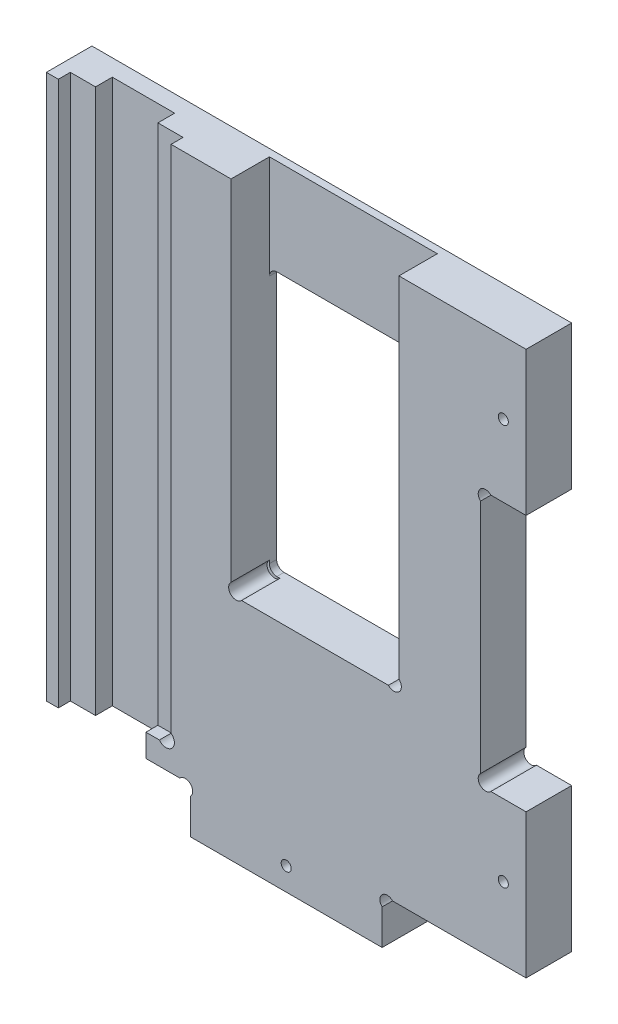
ISO-10303-21;
HEADER;
FILE_DESCRIPTION(('STEP AP214'),'2;1');
FILE_NAME('part.step','',(''),(''),'','','');
FILE_SCHEMA(('AUTOMOTIVE_DESIGN { 1 0 10303 214 1 1 1 1 }'));
ENDSEC;
DATA;
#1=APPLICATION_CONTEXT('core data for automotive mechanical design processes');
#2=APPLICATION_PROTOCOL_DEFINITION('international standard','automotive_design',2000,#1);
#3=PRODUCT_CONTEXT('',#1,'mechanical');
#4=PRODUCT('Part','Part','',(#3));
#5=PRODUCT_RELATED_PRODUCT_CATEGORY('part','',(#4));
#6=PRODUCT_DEFINITION_FORMATION('','',#4);
#7=PRODUCT_DEFINITION_CONTEXT('part definition',#1,'design');
#8=PRODUCT_DEFINITION('design','',#6,#7);
#9=PRODUCT_DEFINITION_SHAPE('','',#8);
#10=(LENGTH_UNIT() NAMED_UNIT(*) SI_UNIT(.MILLI.,.METRE.));
#11=(NAMED_UNIT(*) PLANE_ANGLE_UNIT() SI_UNIT($,.RADIAN.));
#12=(NAMED_UNIT(*) SI_UNIT($,.STERADIAN.) SOLID_ANGLE_UNIT());
#13=UNCERTAINTY_MEASURE_WITH_UNIT(LENGTH_MEASURE(1.E-05),#10,'distance_accuracy_value','');
#14=(GEOMETRIC_REPRESENTATION_CONTEXT(3) GLOBAL_UNCERTAINTY_ASSIGNED_CONTEXT((#13)) GLOBAL_UNIT_ASSIGNED_CONTEXT((#10,
#11,#12)) REPRESENTATION_CONTEXT('',''));
#15=CARTESIAN_POINT('',(0.,0.,0.));
#16=DIRECTION('',(0.,0.,1.));
#17=DIRECTION('',(1.,0.,0.));
#18=AXIS2_PLACEMENT_3D('',#15,#16,#17);
#19=CARTESIAN_POINT('',(655.629179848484,98.1,3.));
#20=DIRECTION('',(0.,0.,1.));
#21=DIRECTION('',(1.,0.,0.));
#22=AXIS2_PLACEMENT_3D('',#19,#20,#21);
#23=PLANE('',#22);
#24=CARTESIAN_POINT('',(590.829179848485,202.9,3.));
#25=DIRECTION('',(0.,0.,1.));
#26=DIRECTION('',(1.,0.,0.));
#27=AXIS2_PLACEMENT_3D('',#24,#25,#26);
#28=CIRCLE('',#27,3.09999999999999);
#29=CARTESIAN_POINT('',(590.829179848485,206.,3.));
#30=VERTEX_POINT('',#29);
#31=CARTESIAN_POINT('',(587.729179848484,202.9,3.));
#32=VERTEX_POINT('',#31);
#33=EDGE_CURVE('E319',#30,#32,#28,.T.);
#34=ORIENTED_EDGE('',*,*,#33,.F.);
#35=DIRECTION('',(-1.,0.,0.));
#36=VECTOR('',#35,1.);
#37=CARTESIAN_POINT('',(590.829179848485,206.,3.));
#38=LINE('',#37,#36);
#39=CARTESIAN_POINT('',(654.629179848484,206.,3.));
#40=VERTEX_POINT('',#39);
#41=EDGE_CURVE('E347',#40,#30,#38,.T.);
#42=ORIENTED_EDGE('',*,*,#41,.F.);
#43=CARTESIAN_POINT('',(654.629179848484,202.9,3.));
#44=DIRECTION('',(0.,0.,1.));
#45=DIRECTION('',(-1.,0.,0.));
#46=AXIS2_PLACEMENT_3D('',#43,#44,#45);
#47=CIRCLE('',#46,3.09999999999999);
#48=CARTESIAN_POINT('',(657.729179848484,202.9,3.));
#49=VERTEX_POINT('',#48);
#50=EDGE_CURVE('E344',#49,#40,#47,.T.);
#51=ORIENTED_EDGE('',*,*,#50,.F.);
#52=DIRECTION('',(0.,1.,0.));
#53=VECTOR('',#52,1.);
#54=CARTESIAN_POINT('',(657.729179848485,100.380350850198,3.));
#55=LINE('',#54,#53);
#56=CARTESIAN_POINT('',(657.729179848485,246.,3.));
#57=VERTEX_POINT('',#56);
#58=EDGE_CURVE('E57',#49,#57,#55,.T.);
#59=ORIENTED_EDGE('',*,*,#58,.T.);
#60=DIRECTION('',(-1.,0.,0.));
#61=VECTOR('',#60,1.);
#62=CARTESIAN_POINT('',(710.729179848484,246.,3.));
#63=LINE('',#62,#61);
#64=CARTESIAN_POINT('',(587.729179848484,246.,3.));
#65=VERTEX_POINT('',#64);
#66=EDGE_CURVE('E605',#57,#65,#63,.T.);
#67=ORIENTED_EDGE('',*,*,#66,.T.);
#68=DIRECTION('',(0.,-1.,0.));
#69=VECTOR('',#68,1.);
#70=CARTESIAN_POINT('',(587.729179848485,100.380350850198,3.));
#71=LINE('',#70,#69);
#72=EDGE_CURVE('E366',#65,#32,#71,.T.);
#73=ORIENTED_EDGE('',*,*,#72,.T.);
#74=EDGE_LOOP('',(#34,#42,#51,#59,#67,#73));
#75=FACE_BOUND('',#74,.T.);
#76=ADVANCED_FACE('F34',(#75),#23,.T.);
#77=DIRECTION('',(0.,-1.,0.));
#78=VECTOR('',#77,1.);
#79=CARTESIAN_POINT('',(587.729179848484,202.9,3.));
#80=LINE('',#79,#78);
#81=CARTESIAN_POINT('',(587.729179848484,100.380350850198,3.));
#82=VERTEX_POINT('',#81);
#83=CARTESIAN_POINT('',(587.729179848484,99.1,3.));
#84=VERTEX_POINT('',#83);
#85=EDGE_CURVE('E317',#82,#84,#80,.T.);
#86=ORIENTED_EDGE('',*,*,#85,.F.);
#87=CARTESIAN_POINT('',(589.829179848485,98.1,3.));
#88=DIRECTION('',(0.,0.,1.));
#89=DIRECTION('',(1.,0.,0.));
#90=AXIS2_PLACEMENT_3D('',#87,#88,#89);
#91=CIRCLE('',#90,3.09999999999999);
#92=CARTESIAN_POINT('',(592.109530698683,96.,3.));
#93=VERTEX_POINT('',#92);
#94=EDGE_CURVE('E369',#82,#93,#91,.T.);
#95=ORIENTED_EDGE('',*,*,#94,.T.);
#96=DIRECTION('',(1.,0.,0.));
#97=VECTOR('',#96,1.);
#98=CARTESIAN_POINT('',(590.829179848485,96.,3.));
#99=LINE('',#98,#97);
#100=CARTESIAN_POINT('',(590.829179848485,96.,3.));
#101=VERTEX_POINT('',#100);
#102=EDGE_CURVE('E337',#101,#93,#99,.T.);
#103=ORIENTED_EDGE('',*,*,#102,.F.);
#104=CARTESIAN_POINT('',(590.829179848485,99.1,3.));
#105=DIRECTION('',(0.,0.,1.));
#106=DIRECTION('',(1.,0.,0.));
#107=AXIS2_PLACEMENT_3D('',#104,#105,#106);
#108=CIRCLE('',#107,3.1);
#109=EDGE_CURVE('E301',#84,#101,#108,.T.);
#110=ORIENTED_EDGE('',*,*,#109,.F.);
#111=EDGE_LOOP('',(#86,#95,#103,#110));
#112=FACE_BOUND('',#111,.T.);
#113=ADVANCED_FACE('F628',(#112),#23,.T.);
#114=CARTESIAN_POINT('',(526.229179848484,250.709420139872,7.));
#115=DIRECTION('',(-1.,0.,0.));
#116=DIRECTION('',(0.,0.,1.));
#117=AXIS2_PLACEMENT_3D('',#114,#115,#116);
#118=PLANE('',#117);
#119=DIRECTION('',(0.,1.,0.));
#120=VECTOR('',#119,1.);
#121=CARTESIAN_POINT('',(526.229179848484,250.709420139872,14.));
#122=LINE('',#121,#120);
#123=CARTESIAN_POINT('',(526.229179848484,19.,14.));
#124=VERTEX_POINT('',#123);
#125=CARTESIAN_POINT('',(526.229179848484,246.,14.));
#126=VERTEX_POINT('',#125);
#127=EDGE_CURVE('E600',#124,#126,#122,.T.);
#128=ORIENTED_EDGE('',*,*,#127,.F.);
#129=DIRECTION('',(0.,0.,1.));
#130=VECTOR('',#129,1.);
#131=CARTESIAN_POINT('',(526.229179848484,19.,19.));
#132=LINE('',#131,#130);
#133=CARTESIAN_POINT('',(526.229179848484,19.,7.));
#134=VERTEX_POINT('',#133);
#135=EDGE_CURVE('E589',#134,#124,#132,.T.);
#136=ORIENTED_EDGE('',*,*,#135,.F.);
#137=DIRECTION('',(0.,-1.,0.));
#138=VECTOR('',#137,1.);
#139=CARTESIAN_POINT('',(526.229179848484,250.709420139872,7.));
#140=LINE('',#139,#138);
#141=CARTESIAN_POINT('',(526.229179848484,246.,7.));
#142=VERTEX_POINT('',#141);
#143=EDGE_CURVE('E432',#142,#134,#140,.T.);
#144=ORIENTED_EDGE('',*,*,#143,.F.);
#145=DIRECTION('',(0.,0.,-1.));
#146=VECTOR('',#145,1.);
#147=CARTESIAN_POINT('',(526.229179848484,246.,19.));
#148=LINE('',#147,#146);
#149=EDGE_CURVE('E445',#126,#142,#148,.T.);
#150=ORIENTED_EDGE('',*,*,#149,.F.);
#151=EDGE_LOOP('',(#128,#136,#144,#150));
#152=FACE_BOUND('',#151,.T.);
#153=ADVANCED_FACE('F659',(#152),#118,.F.);
#154=CARTESIAN_POINT('',(693.829179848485,183.9,19.));
#155=DIRECTION('',(0.,0.,-1.));
#156=DIRECTION('',(-1.,0.,0.));
#157=AXIS2_PLACEMENT_3D('',#154,#155,#156);
#158=PLANE('',#157);
#159=DIRECTION('',(1.,0.,0.));
#160=VECTOR('',#159,1.);
#161=CARTESIAN_POINT('',(566.348828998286,19.,19.));
#162=LINE('',#161,#160);
#163=CARTESIAN_POINT('',(510.729179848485,19.,19.));
#164=VERTEX_POINT('',#163);
#165=CARTESIAN_POINT('',(515.729179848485,19.,19.));
#166=VERTEX_POINT('',#165);
#167=EDGE_CURVE('E482',#164,#166,#162,.T.);
#168=ORIENTED_EDGE('',*,*,#167,.T.);
#169=DIRECTION('',(0.,-1.,0.));
#170=VECTOR('',#169,1.);
#171=CARTESIAN_POINT('',(515.729179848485,251.308022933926,19.));
#172=LINE('',#171,#170);
#173=CARTESIAN_POINT('',(515.729179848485,246.,19.));
#174=VERTEX_POINT('',#173);
#175=EDGE_CURVE('E390',#174,#166,#172,.T.);
#176=ORIENTED_EDGE('',*,*,#175,.F.);
#177=DIRECTION('',(-1.,0.,0.));
#178=VECTOR('',#177,1.);
#179=CARTESIAN_POINT('',(710.729179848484,246.,19.));
#180=LINE('',#179,#178);
#181=CARTESIAN_POINT('',(510.729179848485,246.,19.));
#182=VERTEX_POINT('',#181);
#183=EDGE_CURVE('E474',#174,#182,#180,.T.);
#184=ORIENTED_EDGE('',*,*,#183,.T.);
#185=DIRECTION('',(0.,-1.,0.));
#186=VECTOR('',#185,1.);
#187=CARTESIAN_POINT('',(510.729179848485,19.,19.));
#188=LINE('',#187,#186);
#189=EDGE_CURVE('E478',#182,#164,#188,.T.);
#190=ORIENTED_EDGE('',*,*,#189,.T.);
#191=EDGE_LOOP('',(#168,#176,#184,#190));
#192=FACE_BOUND('',#191,.T.);
#193=ADVANCED_FACE('F710',(#192),#158,.F.);
#194=CARTESIAN_POINT('',(701.229179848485,49.,19.));
#195=DIRECTION('',(0.,0.,1.));
#196=DIRECTION('',(-1.,0.,0.));
#197=AXIS2_PLACEMENT_3D('',#194,#195,#196);
#198=CIRCLE('',#197,2.10000000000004);
#199=CARTESIAN_POINT('',(699.129179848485,49.,19.));
#200=VERTEX_POINT('',#199);
#201=EDGE_CURVE('E454',#200,#200,#198,.T.);
#202=ORIENTED_EDGE('',*,*,#201,.F.);
#203=EDGE_LOOP('',(#202));
#204=FACE_BOUND('',#203,.T.);
#205=CARTESIAN_POINT('',(710.729179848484,246.,19.));
#206=VERTEX_POINT('',#205);
#207=CARTESIAN_POINT('',(657.729179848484,246.,19.));
#208=VERTEX_POINT('',#207);
#209=EDGE_CURVE('E475',#206,#208,#180,.T.);
#210=ORIENTED_EDGE('',*,*,#209,.T.);
#211=DIRECTION('',(0.,1.,0.));
#212=VECTOR('',#211,1.);
#213=CARTESIAN_POINT('',(657.729179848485,100.380350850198,19.));
#214=LINE('',#213,#212);
#215=CARTESIAN_POINT('',(657.729179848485,100.380350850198,19.));
#216=VERTEX_POINT('',#215);
#217=EDGE_CURVE('E370',#216,#208,#214,.T.);
#218=ORIENTED_EDGE('',*,*,#217,.F.);
#219=CARTESIAN_POINT('',(655.629179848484,98.1,19.));
#220=DIRECTION('',(0.,0.,1.));
#221=DIRECTION('',(1.,0.,0.));
#222=AXIS2_PLACEMENT_3D('',#219,#220,#221);
#223=CIRCLE('',#222,3.1);
#224=CARTESIAN_POINT('',(653.348828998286,96.,19.));
#225=VERTEX_POINT('',#224);
#226=EDGE_CURVE('E384',#225,#216,#223,.T.);
#227=ORIENTED_EDGE('',*,*,#226,.F.);
#228=DIRECTION('',(1.,0.,0.));
#229=VECTOR('',#228,1.);
#230=CARTESIAN_POINT('',(592.109530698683,96.,19.));
#231=LINE('',#230,#229);
#232=CARTESIAN_POINT('',(592.109530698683,96.,19.));
#233=VERTEX_POINT('',#232);
#234=EDGE_CURVE('E382',#233,#225,#231,.T.);
#235=ORIENTED_EDGE('',*,*,#234,.F.);
#236=CARTESIAN_POINT('',(589.829179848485,98.1,19.));
#237=DIRECTION('',(0.,0.,1.));
#238=DIRECTION('',(1.,0.,0.));
#239=AXIS2_PLACEMENT_3D('',#236,#237,#238);
#240=CIRCLE('',#239,3.09999999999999);
#241=CARTESIAN_POINT('',(587.729179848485,100.380350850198,19.));
#242=VERTEX_POINT('',#241);
#243=EDGE_CURVE('E379',#242,#233,#240,.T.);
#244=ORIENTED_EDGE('',*,*,#243,.F.);
#245=DIRECTION('',(0.,-1.,0.));
#246=VECTOR('',#245,1.);
#247=CARTESIAN_POINT('',(587.729179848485,100.380350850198,19.));
#248=LINE('',#247,#246);
#249=CARTESIAN_POINT('',(587.729179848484,246.,19.));
#250=VERTEX_POINT('',#249);
#251=EDGE_CURVE('E354',#250,#242,#248,.T.);
#252=ORIENTED_EDGE('',*,*,#251,.F.);
#253=CARTESIAN_POINT('',(562.729179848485,246.,19.));
#254=VERTEX_POINT('',#253);
#255=EDGE_CURVE('E479',#250,#254,#180,.T.);
#256=ORIENTED_EDGE('',*,*,#255,.T.);
#257=DIRECTION('',(0.,1.,0.));
#258=VECTOR('',#257,1.);
#259=CARTESIAN_POINT('',(562.729179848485,251.308022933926,19.));
#260=LINE('',#259,#258);
#261=CARTESIAN_POINT('',(562.729179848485,33.3803508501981,19.));
#262=VERTEX_POINT('',#261);
#263=EDGE_CURVE('E408',#262,#254,#260,.T.);
#264=ORIENTED_EDGE('',*,*,#263,.F.);
#265=CARTESIAN_POINT('',(560.629179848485,30.6,19.));
#266=DIRECTION('',(0.,0.,1.));
#267=DIRECTION('',(1.,0.,0.));
#268=AXIS2_PLACEMENT_3D('',#265,#266,#267);
#269=CIRCLE('',#268,3.48430062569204);
#270=CARTESIAN_POINT('',(557.848828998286,28.5,19.));
#271=VERTEX_POINT('',#270);
#272=EDGE_CURVE('E413',#271,#262,#269,.T.);
#273=ORIENTED_EDGE('',*,*,#272,.F.);
#274=DIRECTION('',(1.,0.,0.));
#275=VECTOR('',#274,1.);
#276=CARTESIAN_POINT('',(557.848828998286,28.5,19.));
#277=LINE('',#276,#275);
#278=CARTESIAN_POINT('',(552.229179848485,28.5,19.));
#279=VERTEX_POINT('',#278);
#280=EDGE_CURVE('E421',#279,#271,#277,.T.);
#281=ORIENTED_EDGE('',*,*,#280,.F.);
#282=DIRECTION('',(0.,1.,0.));
#283=VECTOR('',#282,1.);
#284=CARTESIAN_POINT('',(552.229179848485,250.709420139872,19.));
#285=LINE('',#284,#283);
#286=CARTESIAN_POINT('',(552.229179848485,19.,19.));
#287=VERTEX_POINT('',#286);
#288=EDGE_CURVE('E431',#287,#279,#285,.T.);
#289=ORIENTED_EDGE('',*,*,#288,.F.);
#290=CARTESIAN_POINT('',(566.348828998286,19.,19.));
#291=VERTEX_POINT('',#290);
#292=EDGE_CURVE('E481',#287,#291,#162,.T.);
#293=ORIENTED_EDGE('',*,*,#292,.T.);
#294=CARTESIAN_POINT('',(568.629179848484,16.9,19.));
#295=DIRECTION('',(0.,0.,-1.));
#296=DIRECTION('',(-1.,0.,0.));
#297=AXIS2_PLACEMENT_3D('',#294,#295,#296);
#298=CIRCLE('',#297,3.09999999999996);
#299=CARTESIAN_POINT('',(570.729179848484,14.6196491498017,19.));
#300=VERTEX_POINT('',#299);
#301=EDGE_CURVE('E485',#291,#300,#298,.T.);
#302=ORIENTED_EDGE('',*,*,#301,.T.);
#303=DIRECTION('',(0.,-1.,0.));
#304=VECTOR('',#303,1.);
#305=CARTESIAN_POINT('',(570.729179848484,0.,19.));
#306=LINE('',#305,#304);
#307=CARTESIAN_POINT('',(570.729179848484,0.,19.));
#308=VERTEX_POINT('',#307);
#309=EDGE_CURVE('E487',#300,#308,#306,.T.);
#310=ORIENTED_EDGE('',*,*,#309,.T.);
#311=DIRECTION('',(1.,0.,0.));
#312=VECTOR('',#311,1.);
#313=CARTESIAN_POINT('',(650.729179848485,0.,19.));
#314=LINE('',#313,#312);
#315=CARTESIAN_POINT('',(650.729179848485,0.,19.));
#316=VERTEX_POINT('',#315);
#317=EDGE_CURVE('E489',#308,#316,#314,.T.);
#318=ORIENTED_EDGE('',*,*,#317,.T.);
#319=DIRECTION('',(0.,1.,0.));
#320=VECTOR('',#319,1.);
#321=CARTESIAN_POINT('',(650.729179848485,0.,19.));
#322=LINE('',#321,#320);
#323=CARTESIAN_POINT('',(650.729179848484,14.6881003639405,19.));
#324=VERTEX_POINT('',#323);
#325=EDGE_CURVE('E491',#316,#324,#322,.T.);
#326=ORIENTED_EDGE('',*,*,#325,.T.);
#327=CARTESIAN_POINT('',(652.829179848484,16.9,19.));
#328=DIRECTION('',(0.,0.,-1.));
#329=DIRECTION('',(-1.,0.,0.));
#330=AXIS2_PLACEMENT_3D('',#327,#328,#329);
#331=CIRCLE('',#330,3.05000000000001);
#332=CARTESIAN_POINT('',(655.041079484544,19.,19.));
#333=VERTEX_POINT('',#332);
#334=EDGE_CURVE('E493',#324,#333,#331,.T.);
#335=ORIENTED_EDGE('',*,*,#334,.T.);
#336=DIRECTION('',(1.,0.,0.));
#337=VECTOR('',#336,1.);
#338=CARTESIAN_POINT('',(655.041079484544,19.,19.));
#339=LINE('',#338,#337);
#340=CARTESIAN_POINT('',(710.729179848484,19.,19.));
#341=VERTEX_POINT('',#340);
#342=EDGE_CURVE('E495',#333,#341,#339,.T.);
#343=ORIENTED_EDGE('',*,*,#342,.T.);
#344=DIRECTION('',(0.,1.,0.));
#345=VECTOR('',#344,1.);
#346=CARTESIAN_POINT('',(710.729179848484,19.,19.));
#347=LINE('',#346,#345);
#348=CARTESIAN_POINT('',(710.729179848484,79.0000000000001,19.));
#349=VERTEX_POINT('',#348);
#350=EDGE_CURVE('E497',#341,#349,#347,.T.);
#351=ORIENTED_EDGE('',*,*,#350,.T.);
#352=DIRECTION('',(-1.,0.,0.));
#353=VECTOR('',#352,1.);
#354=CARTESIAN_POINT('',(696.041079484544,79.0000000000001,19.));
#355=LINE('',#354,#353);
#356=CARTESIAN_POINT('',(696.041079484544,79.0000000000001,19.));
#357=VERTEX_POINT('',#356);
#358=EDGE_CURVE('E499',#349,#357,#355,.T.);
#359=ORIENTED_EDGE('',*,*,#358,.T.);
#360=CARTESIAN_POINT('',(693.829179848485,81.1000000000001,19.));
#361=DIRECTION('',(0.,0.,-1.));
#362=DIRECTION('',(-1.,0.,0.));
#363=AXIS2_PLACEMENT_3D('',#360,#361,#362);
#364=CIRCLE('',#363,3.05000000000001);
#365=CARTESIAN_POINT('',(691.729179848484,83.3118996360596,19.));
#366=VERTEX_POINT('',#365);
#367=EDGE_CURVE('E501',#357,#366,#364,.T.);
#368=ORIENTED_EDGE('',*,*,#367,.T.);
#369=DIRECTION('',(0.,1.,0.));
#370=VECTOR('',#369,1.);
#371=CARTESIAN_POINT('',(691.729179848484,181.688100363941,19.));
#372=LINE('',#371,#370);
#373=CARTESIAN_POINT('',(691.729179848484,181.688100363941,19.));
#374=VERTEX_POINT('',#373);
#375=EDGE_CURVE('E503',#366,#374,#372,.T.);
#376=ORIENTED_EDGE('',*,*,#375,.T.);
#377=CARTESIAN_POINT('',(693.829179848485,183.9,19.));
#378=DIRECTION('',(0.,0.,-1.));
#379=DIRECTION('',(-1.,0.,0.));
#380=AXIS2_PLACEMENT_3D('',#377,#378,#379);
#381=CIRCLE('',#380,3.05000000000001);
#382=CARTESIAN_POINT('',(696.041079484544,186.,19.));
#383=VERTEX_POINT('',#382);
#384=EDGE_CURVE('E466',#374,#383,#381,.T.);
#385=ORIENTED_EDGE('',*,*,#384,.T.);
#386=DIRECTION('',(1.,0.,0.));
#387=VECTOR('',#386,1.);
#388=CARTESIAN_POINT('',(710.729179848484,186.,19.));
#389=LINE('',#388,#387);
#390=CARTESIAN_POINT('',(710.729179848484,186.,19.));
#391=VERTEX_POINT('',#390);
#392=EDGE_CURVE('E469',#383,#391,#389,.T.);
#393=ORIENTED_EDGE('',*,*,#392,.T.);
#394=DIRECTION('',(0.,1.,0.));
#395=VECTOR('',#394,1.);
#396=CARTESIAN_POINT('',(710.729179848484,186.,19.));
#397=LINE('',#396,#395);
#398=EDGE_CURVE('E472',#391,#206,#397,.T.);
#399=ORIENTED_EDGE('',*,*,#398,.T.);
#400=EDGE_LOOP('',(#210,#218,#227,#235,#244,#252,#256,#264,#273,#281,#289,#293,#302,#310,#318,
#326,#335,#343,#351,#359,#368,#376,#385,#393,#399));
#401=FACE_BOUND('',#400,.T.);
#402=CARTESIAN_POINT('',(701.229179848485,216.,19.));
#403=DIRECTION('',(0.,0.,1.));
#404=DIRECTION('',(1.,0.,0.));
#405=AXIS2_PLACEMENT_3D('',#402,#403,#404);
#406=CIRCLE('',#405,2.10000000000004);
#407=CARTESIAN_POINT('',(703.329179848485,216.,19.));
#408=VERTEX_POINT('',#407);
#409=EDGE_CURVE('E460',#408,#408,#406,.T.);
#410=ORIENTED_EDGE('',*,*,#409,.F.);
#411=EDGE_LOOP('',(#410));
#412=FACE_BOUND('',#411,.T.);
#413=CARTESIAN_POINT('',(610.729179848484,9.5,19.));
#414=DIRECTION('',(0.,0.,1.));
#415=DIRECTION('',(-1.,0.,0.));
#416=AXIS2_PLACEMENT_3D('',#413,#414,#415);
#417=CIRCLE('',#416,2.10000000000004);
#418=CARTESIAN_POINT('',(608.629179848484,9.5,19.));
#419=VERTEX_POINT('',#418);
#420=EDGE_CURVE('E448',#419,#419,#417,.T.);
#421=ORIENTED_EDGE('',*,*,#420,.F.);
#422=EDGE_LOOP('',(#421));
#423=FACE_BOUND('',#422,.T.);
#424=ADVANCED_FACE('F618',(#204,#401,#412,#423),#158,.F.);
#425=CARTESIAN_POINT('',(693.829179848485,183.9,0.));
#426=DIRECTION('',(0.,0.,-1.));
#427=DIRECTION('',(-1.,0.,0.));
#428=AXIS2_PLACEMENT_3D('',#425,#426,#427);
#429=PLANE('',#428);
#430=CARTESIAN_POINT('',(590.829179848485,99.1,0.));
#431=DIRECTION('',(0.,0.,1.));
#432=DIRECTION('',(1.,0.,0.));
#433=AXIS2_PLACEMENT_3D('',#430,#431,#432);
#434=CIRCLE('',#433,3.1);
#435=CARTESIAN_POINT('',(587.729179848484,99.1,0.));
#436=VERTEX_POINT('',#435);
#437=CARTESIAN_POINT('',(590.829179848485,96.,0.));
#438=VERTEX_POINT('',#437);
#439=EDGE_CURVE('E298',#436,#438,#434,.T.);
#440=ORIENTED_EDGE('',*,*,#439,.T.);
#441=DIRECTION('',(1.,0.,0.));
#442=VECTOR('',#441,1.);
#443=CARTESIAN_POINT('',(590.829179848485,96.,0.));
#444=LINE('',#443,#442);
#445=CARTESIAN_POINT('',(654.629179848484,96.,0.));
#446=VERTEX_POINT('',#445);
#447=EDGE_CURVE('E308',#438,#446,#444,.T.);
#448=ORIENTED_EDGE('',*,*,#447,.T.);
#449=CARTESIAN_POINT('',(654.629179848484,99.1,0.));
#450=DIRECTION('',(0.,0.,1.));
#451=DIRECTION('',(1.,0.,0.));
#452=AXIS2_PLACEMENT_3D('',#449,#450,#451);
#453=CIRCLE('',#452,3.1);
#454=CARTESIAN_POINT('',(657.729179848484,99.1,0.));
#455=VERTEX_POINT('',#454);
#456=EDGE_CURVE('E49',#446,#455,#453,.T.);
#457=ORIENTED_EDGE('',*,*,#456,.T.);
#458=DIRECTION('',(0.,1.,0.));
#459=VECTOR('',#458,1.);
#460=CARTESIAN_POINT('',(657.729179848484,202.9,0.));
#461=LINE('',#460,#459);
#462=CARTESIAN_POINT('',(657.729179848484,202.9,0.));
#463=VERTEX_POINT('',#462);
#464=EDGE_CURVE('E323',#455,#463,#461,.T.);
#465=ORIENTED_EDGE('',*,*,#464,.T.);
#466=CARTESIAN_POINT('',(654.629179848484,202.9,0.));
#467=DIRECTION('',(0.,0.,1.));
#468=DIRECTION('',(-1.,0.,0.));
#469=AXIS2_PLACEMENT_3D('',#466,#467,#468);
#470=CIRCLE('',#469,3.09999999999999);
#471=CARTESIAN_POINT('',(654.629179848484,206.,0.));
#472=VERTEX_POINT('',#471);
#473=EDGE_CURVE('E326',#463,#472,#470,.T.);
#474=ORIENTED_EDGE('',*,*,#473,.T.);
#475=DIRECTION('',(-1.,0.,0.));
#476=VECTOR('',#475,1.);
#477=CARTESIAN_POINT('',(590.829179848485,206.,0.));
#478=LINE('',#477,#476);
#479=CARTESIAN_POINT('',(590.829179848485,206.,0.));
#480=VERTEX_POINT('',#479);
#481=EDGE_CURVE('E329',#472,#480,#478,.T.);
#482=ORIENTED_EDGE('',*,*,#481,.T.);
#483=CARTESIAN_POINT('',(590.829179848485,202.9,0.));
#484=DIRECTION('',(0.,0.,1.));
#485=DIRECTION('',(1.,0.,0.));
#486=AXIS2_PLACEMENT_3D('',#483,#484,#485);
#487=CIRCLE('',#486,3.09999999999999);
#488=CARTESIAN_POINT('',(587.729179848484,202.9,0.));
#489=VERTEX_POINT('',#488);
#490=EDGE_CURVE('E332',#480,#489,#487,.T.);
#491=ORIENTED_EDGE('',*,*,#490,.T.);
#492=DIRECTION('',(0.,-1.,0.));
#493=VECTOR('',#492,1.);
#494=CARTESIAN_POINT('',(587.729179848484,202.9,0.));
#495=LINE('',#494,#493);
#496=EDGE_CURVE('E305',#489,#436,#495,.T.);
#497=ORIENTED_EDGE('',*,*,#496,.T.);
#498=EDGE_LOOP('',(#440,#448,#457,#465,#474,#482,#491,#497));
#499=FACE_BOUND('',#498,.T.);
#500=CARTESIAN_POINT('',(701.229179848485,49.,0.));
#501=DIRECTION('',(0.,0.,1.));
#502=DIRECTION('',(-1.,0.,0.));
#503=AXIS2_PLACEMENT_3D('',#500,#501,#502);
#504=CIRCLE('',#503,2.10000000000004);
#505=CARTESIAN_POINT('',(699.129179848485,49.,0.));
#506=VERTEX_POINT('',#505);
#507=EDGE_CURVE('E451',#506,#506,#504,.T.);
#508=ORIENTED_EDGE('',*,*,#507,.T.);
#509=EDGE_LOOP('',(#508));
#510=FACE_BOUND('',#509,.T.);
#511=CARTESIAN_POINT('',(693.829179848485,183.9,0.));
#512=DIRECTION('',(0.,0.,-1.));
#513=DIRECTION('',(-1.,0.,0.));
#514=AXIS2_PLACEMENT_3D('',#511,#512,#513);
#515=CIRCLE('',#514,3.05000000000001);
#516=CARTESIAN_POINT('',(691.729179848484,181.688100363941,0.));
#517=VERTEX_POINT('',#516);
#518=CARTESIAN_POINT('',(696.041079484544,186.,0.));
#519=VERTEX_POINT('',#518);
#520=EDGE_CURVE('E463',#517,#519,#515,.T.);
#521=ORIENTED_EDGE('',*,*,#520,.F.);
#522=DIRECTION('',(0.,1.,0.));
#523=VECTOR('',#522,1.);
#524=CARTESIAN_POINT('',(691.729179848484,181.688100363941,0.));
#525=LINE('',#524,#523);
#526=CARTESIAN_POINT('',(691.729179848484,83.3118996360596,0.));
#527=VERTEX_POINT('',#526);
#528=EDGE_CURVE('E470',#527,#517,#525,.T.);
#529=ORIENTED_EDGE('',*,*,#528,.F.);
#530=CARTESIAN_POINT('',(693.829179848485,81.1000000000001,0.));
#531=DIRECTION('',(0.,0.,-1.));
#532=DIRECTION('',(-1.,0.,0.));
#533=AXIS2_PLACEMENT_3D('',#530,#531,#532);
#534=CIRCLE('',#533,3.05000000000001);
#535=CARTESIAN_POINT('',(696.041079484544,79.0000000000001,0.));
#536=VERTEX_POINT('',#535);
#537=EDGE_CURVE('E534',#536,#527,#534,.T.);
#538=ORIENTED_EDGE('',*,*,#537,.F.);
#539=DIRECTION('',(-1.,0.,0.));
#540=VECTOR('',#539,1.);
#541=CARTESIAN_POINT('',(696.041079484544,79.0000000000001,0.));
#542=LINE('',#541,#540);
#543=CARTESIAN_POINT('',(710.729179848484,79.0000000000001,0.));
#544=VERTEX_POINT('',#543);
#545=EDGE_CURVE('E532',#544,#536,#542,.T.);
#546=ORIENTED_EDGE('',*,*,#545,.F.);
#547=DIRECTION('',(0.,1.,0.));
#548=VECTOR('',#547,1.);
#549=CARTESIAN_POINT('',(710.729179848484,19.,0.));
#550=LINE('',#549,#548);
#551=CARTESIAN_POINT('',(710.729179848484,19.,0.));
#552=VERTEX_POINT('',#551);
#553=EDGE_CURVE('E530',#552,#544,#550,.T.);
#554=ORIENTED_EDGE('',*,*,#553,.F.);
#555=DIRECTION('',(1.,0.,0.));
#556=VECTOR('',#555,1.);
#557=CARTESIAN_POINT('',(655.041079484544,19.,0.));
#558=LINE('',#557,#556);
#559=CARTESIAN_POINT('',(655.041079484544,19.,0.));
#560=VERTEX_POINT('',#559);
#561=EDGE_CURVE('E528',#560,#552,#558,.T.);
#562=ORIENTED_EDGE('',*,*,#561,.F.);
#563=CARTESIAN_POINT('',(652.829179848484,16.9,0.));
#564=DIRECTION('',(0.,0.,-1.));
#565=DIRECTION('',(-1.,0.,0.));
#566=AXIS2_PLACEMENT_3D('',#563,#564,#565);
#567=CIRCLE('',#566,3.05000000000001);
#568=CARTESIAN_POINT('',(650.729179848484,14.6881003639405,0.));
#569=VERTEX_POINT('',#568);
#570=EDGE_CURVE('E526',#569,#560,#567,.T.);
#571=ORIENTED_EDGE('',*,*,#570,.F.);
#572=DIRECTION('',(0.,1.,0.));
#573=VECTOR('',#572,1.);
#574=CARTESIAN_POINT('',(650.729179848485,0.,0.));
#575=LINE('',#574,#573);
#576=CARTESIAN_POINT('',(650.729179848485,0.,0.));
#577=VERTEX_POINT('',#576);
#578=EDGE_CURVE('E524',#577,#569,#575,.T.);
#579=ORIENTED_EDGE('',*,*,#578,.F.);
#580=DIRECTION('',(1.,0.,0.));
#581=VECTOR('',#580,1.);
#582=CARTESIAN_POINT('',(650.729179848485,0.,0.));
#583=LINE('',#582,#581);
#584=CARTESIAN_POINT('',(570.729179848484,0.,0.));
#585=VERTEX_POINT('',#584);
#586=EDGE_CURVE('E522',#585,#577,#583,.T.);
#587=ORIENTED_EDGE('',*,*,#586,.F.);
#588=DIRECTION('',(0.,-1.,0.));
#589=VECTOR('',#588,1.);
#590=CARTESIAN_POINT('',(570.729179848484,0.,0.));
#591=LINE('',#590,#589);
#592=CARTESIAN_POINT('',(570.729179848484,14.6196491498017,0.));
#593=VERTEX_POINT('',#592);
#594=EDGE_CURVE('E520',#593,#585,#591,.T.);
#595=ORIENTED_EDGE('',*,*,#594,.F.);
#596=CARTESIAN_POINT('',(568.629179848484,16.9,0.));
#597=DIRECTION('',(0.,0.,-1.));
#598=DIRECTION('',(-1.,0.,0.));
#599=AXIS2_PLACEMENT_3D('',#596,#597,#598);
#600=CIRCLE('',#599,3.09999999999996);
#601=CARTESIAN_POINT('',(566.348828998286,19.,0.));
#602=VERTEX_POINT('',#601);
#603=EDGE_CURVE('E518',#602,#593,#600,.T.);
#604=ORIENTED_EDGE('',*,*,#603,.F.);
#605=DIRECTION('',(1.,0.,0.));
#606=VECTOR('',#605,1.);
#607=CARTESIAN_POINT('',(566.348828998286,19.,0.));
#608=LINE('',#607,#606);
#609=CARTESIAN_POINT('',(510.729179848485,19.,0.));
#610=VERTEX_POINT('',#609);
#611=EDGE_CURVE('E516',#610,#602,#608,.T.);
#612=ORIENTED_EDGE('',*,*,#611,.F.);
#613=DIRECTION('',(0.,-1.,0.));
#614=VECTOR('',#613,1.);
#615=CARTESIAN_POINT('',(510.729179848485,19.,0.));
#616=LINE('',#615,#614);
#617=CARTESIAN_POINT('',(510.729179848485,246.,0.));
#618=VERTEX_POINT('',#617);
#619=EDGE_CURVE('E514',#618,#610,#616,.T.);
#620=ORIENTED_EDGE('',*,*,#619,.F.);
#621=DIRECTION('',(-1.,0.,0.));
#622=VECTOR('',#621,1.);
#623=CARTESIAN_POINT('',(710.729179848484,246.,0.));
#624=LINE('',#623,#622);
#625=CARTESIAN_POINT('',(710.729179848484,246.,0.));
#626=VERTEX_POINT('',#625);
#627=EDGE_CURVE('E512',#626,#618,#624,.T.);
#628=ORIENTED_EDGE('',*,*,#627,.F.);
#629=DIRECTION('',(0.,1.,0.));
#630=VECTOR('',#629,1.);
#631=CARTESIAN_POINT('',(710.729179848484,186.,0.));
#632=LINE('',#631,#630);
#633=CARTESIAN_POINT('',(710.729179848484,186.,0.));
#634=VERTEX_POINT('',#633);
#635=EDGE_CURVE('E510',#634,#626,#632,.T.);
#636=ORIENTED_EDGE('',*,*,#635,.F.);
#637=DIRECTION('',(1.,0.,0.));
#638=VECTOR('',#637,1.);
#639=CARTESIAN_POINT('',(710.729179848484,186.,0.));
#640=LINE('',#639,#638);
#641=EDGE_CURVE('E508',#519,#634,#640,.T.);
#642=ORIENTED_EDGE('',*,*,#641,.F.);
#643=EDGE_LOOP('',(#521,#529,#538,#546,#554,#562,#571,#579,#587,#595,#604,#612,#620,#628,#636,#642));
#644=FACE_BOUND('',#643,.T.);
#645=CARTESIAN_POINT('',(701.229179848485,216.,0.));
#646=DIRECTION('',(0.,0.,1.));
#647=DIRECTION('',(1.,0.,0.));
#648=AXIS2_PLACEMENT_3D('',#645,#646,#647);
#649=CIRCLE('',#648,2.10000000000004);
#650=CARTESIAN_POINT('',(703.329179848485,216.,0.));
#651=VERTEX_POINT('',#650);
#652=EDGE_CURVE('E457',#651,#651,#649,.T.);
#653=ORIENTED_EDGE('',*,*,#652,.T.);
#654=EDGE_LOOP('',(#653));
#655=FACE_BOUND('',#654,.T.);
#656=CARTESIAN_POINT('',(610.729179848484,9.5,0.));
#657=DIRECTION('',(0.,0.,1.));
#658=DIRECTION('',(-1.,0.,0.));
#659=AXIS2_PLACEMENT_3D('',#656,#657,#658);
#660=CIRCLE('',#659,2.10000000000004);
#661=CARTESIAN_POINT('',(608.629179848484,9.5,0.));
#662=VERTEX_POINT('',#661);
#663=EDGE_CURVE('E447',#662,#662,#660,.T.);
#664=ORIENTED_EDGE('',*,*,#663,.T.);
#665=EDGE_LOOP('',(#664));
#666=FACE_BOUND('',#665,.T.);
#667=ADVANCED_FACE('F313',(#499,#510,#644,#655,#666),#429,.T.);
#668=CARTESIAN_POINT('',(693.829179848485,183.9,19.));
#669=DIRECTION('',(0.,0.,-1.));
#670=DIRECTION('',(-1.,0.,0.));
#671=AXIS2_PLACEMENT_3D('',#668,#669,#670);
#672=CYLINDRICAL_SURFACE('',#671,3.05000000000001);
#673=ORIENTED_EDGE('',*,*,#520,.T.);
#674=DIRECTION('',(0.,0.,-1.));
#675=VECTOR('',#674,1.);
#676=CARTESIAN_POINT('',(696.041079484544,186.,19.));
#677=LINE('',#676,#675);
#678=EDGE_CURVE('E581',#383,#519,#677,.T.);
#679=ORIENTED_EDGE('',*,*,#678,.F.);
#680=ORIENTED_EDGE('',*,*,#384,.F.);
#681=DIRECTION('',(0.,0.,-1.));
#682=VECTOR('',#681,1.);
#683=CARTESIAN_POINT('',(691.729179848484,181.688100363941,19.));
#684=LINE('',#683,#682);
#685=EDGE_CURVE('E505',#374,#517,#684,.T.);
#686=ORIENTED_EDGE('',*,*,#685,.T.);
#687=EDGE_LOOP('',(#673,#679,#680,#686));
#688=FACE_BOUND('',#687,.T.);
#689=ADVANCED_FACE('F36',(#688),#672,.F.);
#690=CARTESIAN_POINT('',(710.729179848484,186.,19.));
#691=DIRECTION('',(0.,1.,0.));
#692=DIRECTION('',(0.,0.,1.));
#693=AXIS2_PLACEMENT_3D('',#690,#691,#692);
#694=PLANE('',#693);
#695=ORIENTED_EDGE('',*,*,#641,.T.);
#696=DIRECTION('',(0.,0.,-1.));
#697=VECTOR('',#696,1.);
#698=CARTESIAN_POINT('',(710.729179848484,186.,19.));
#699=LINE('',#698,#697);
#700=EDGE_CURVE('E578',#391,#634,#699,.T.);
#701=ORIENTED_EDGE('',*,*,#700,.F.);
#702=ORIENTED_EDGE('',*,*,#392,.F.);
#703=ORIENTED_EDGE('',*,*,#678,.T.);
#704=EDGE_LOOP('',(#695,#701,#702,#703));
#705=FACE_BOUND('',#704,.T.);
#706=ADVANCED_FACE('F780',(#705),#694,.F.);
#707=CARTESIAN_POINT('',(710.729179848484,186.,19.));
#708=DIRECTION('',(-1.,0.,0.));
#709=DIRECTION('',(0.,0.,1.));
#710=AXIS2_PLACEMENT_3D('',#707,#708,#709);
#711=PLANE('',#710);
#712=ORIENTED_EDGE('',*,*,#635,.T.);
#713=DIRECTION('',(0.,0.,-1.));
#714=VECTOR('',#713,1.);
#715=CARTESIAN_POINT('',(710.729179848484,246.,19.));
#716=LINE('',#715,#714);
#717=EDGE_CURVE('E575',#206,#626,#716,.T.);
#718=ORIENTED_EDGE('',*,*,#717,.F.);
#719=ORIENTED_EDGE('',*,*,#398,.F.);
#720=ORIENTED_EDGE('',*,*,#700,.T.);
#721=EDGE_LOOP('',(#712,#718,#719,#720));
#722=FACE_BOUND('',#721,.T.);
#723=ADVANCED_FACE('F778',(#722),#711,.F.);
#724=CARTESIAN_POINT('',(710.729179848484,246.,19.));
#725=DIRECTION('',(0.,-1.,0.));
#726=DIRECTION('',(0.,0.,-1.));
#727=AXIS2_PLACEMENT_3D('',#724,#725,#726);
#728=PLANE('',#727);
#729=ORIENTED_EDGE('',*,*,#66,.F.);
#730=DIRECTION('',(0.,0.,1.));
#731=VECTOR('',#730,1.);
#732=CARTESIAN_POINT('',(657.729179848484,246.,19.));
#733=LINE('',#732,#731);
#734=EDGE_CURVE('E11',#57,#208,#733,.T.);
#735=ORIENTED_EDGE('',*,*,#734,.T.);
#736=ORIENTED_EDGE('',*,*,#209,.F.);
#737=ORIENTED_EDGE('',*,*,#717,.T.);
#738=ORIENTED_EDGE('',*,*,#627,.T.);
#739=DIRECTION('',(0.,0.,-1.));
#740=VECTOR('',#739,1.);
#741=CARTESIAN_POINT('',(510.729179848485,246.,19.));
#742=LINE('',#741,#740);
#743=EDGE_CURVE('E572',#182,#618,#742,.T.);
#744=ORIENTED_EDGE('',*,*,#743,.F.);
#745=ORIENTED_EDGE('',*,*,#183,.F.);
#746=DIRECTION('',(0.,0.,-1.));
#747=VECTOR('',#746,1.);
#748=CARTESIAN_POINT('',(515.729179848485,246.,19.));
#749=LINE('',#748,#747);
#750=CARTESIAN_POINT('',(515.729179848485,246.,14.));
#751=VERTEX_POINT('',#750);
#752=EDGE_CURVE('E405',#174,#751,#749,.T.);
#753=ORIENTED_EDGE('',*,*,#752,.T.);
#754=DIRECTION('',(-1.,0.,0.));
#755=VECTOR('',#754,1.);
#756=CARTESIAN_POINT('',(710.729179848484,246.,14.));
#757=LINE('',#756,#755);
#758=EDGE_CURVE('E403',#126,#751,#757,.T.);
#759=ORIENTED_EDGE('',*,*,#758,.F.);
#760=ORIENTED_EDGE('',*,*,#149,.T.);
#761=DIRECTION('',(-1.,0.,0.));
#762=VECTOR('',#761,1.);
#763=CARTESIAN_POINT('',(710.729179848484,246.,7.));
#764=LINE('',#763,#762);
#765=CARTESIAN_POINT('',(552.229179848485,246.,7.));
#766=VERTEX_POINT('',#765);
#767=EDGE_CURVE('E437',#766,#142,#764,.T.);
#768=ORIENTED_EDGE('',*,*,#767,.F.);
#769=DIRECTION('',(0.,0.,1.));
#770=VECTOR('',#769,1.);
#771=CARTESIAN_POINT('',(552.229179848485,246.,19.));
#772=LINE('',#771,#770);
#773=CARTESIAN_POINT('',(552.229179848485,246.,14.));
#774=VERTEX_POINT('',#773);
#775=EDGE_CURVE('E442',#766,#774,#772,.T.);
#776=ORIENTED_EDGE('',*,*,#775,.T.);
#777=DIRECTION('',(-1.,0.,0.));
#778=VECTOR('',#777,1.);
#779=CARTESIAN_POINT('',(710.729179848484,246.,14.));
#780=LINE('',#779,#778);
#781=CARTESIAN_POINT('',(562.729179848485,246.,14.));
#782=VERTEX_POINT('',#781);
#783=EDGE_CURVE('E427',#782,#774,#780,.T.);
#784=ORIENTED_EDGE('',*,*,#783,.F.);
#785=DIRECTION('',(0.,0.,1.));
#786=VECTOR('',#785,1.);
#787=CARTESIAN_POINT('',(562.729179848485,246.,19.));
#788=LINE('',#787,#786);
#789=EDGE_CURVE('E597',#782,#254,#788,.T.);
#790=ORIENTED_EDGE('',*,*,#789,.T.);
#791=ORIENTED_EDGE('',*,*,#255,.F.);
#792=DIRECTION('',(0.,0.,-1.));
#793=VECTOR('',#792,1.);
#794=CARTESIAN_POINT('',(587.729179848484,246.,19.));
#795=LINE('',#794,#793);
#796=EDGE_CURVE('E42',#250,#65,#795,.T.);
#797=ORIENTED_EDGE('',*,*,#796,.T.);
#798=EDGE_LOOP('',(#729,#735,#736,#737,#738,#744,#745,#753,#759,#760,#768,#776,#784,#790,#791,#797));
#799=FACE_BOUND('',#798,.T.);
#800=ADVANCED_FACE('F610',(#799),#728,.F.);
#801=CARTESIAN_POINT('',(510.729179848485,19.,19.));
#802=DIRECTION('',(1.,0.,0.));
#803=DIRECTION('',(0.,0.,-1.));
#804=AXIS2_PLACEMENT_3D('',#801,#802,#803);
#805=PLANE('',#804);
#806=ORIENTED_EDGE('',*,*,#619,.T.);
#807=DIRECTION('',(0.,0.,-1.));
#808=VECTOR('',#807,1.);
#809=CARTESIAN_POINT('',(510.729179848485,19.,19.));
#810=LINE('',#809,#808);
#811=EDGE_CURVE('E569',#164,#610,#810,.T.);
#812=ORIENTED_EDGE('',*,*,#811,.F.);
#813=ORIENTED_EDGE('',*,*,#189,.F.);
#814=ORIENTED_EDGE('',*,*,#743,.T.);
#815=EDGE_LOOP('',(#806,#812,#813,#814));
#816=FACE_BOUND('',#815,.T.);
#817=ADVANCED_FACE('F771',(#816),#805,.F.);
#818=CARTESIAN_POINT('',(566.348828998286,19.,19.));
#819=DIRECTION('',(0.,1.,0.));
#820=DIRECTION('',(0.,0.,1.));
#821=AXIS2_PLACEMENT_3D('',#818,#819,#820);
#822=PLANE('',#821);
#823=DIRECTION('',(1.,0.,0.));
#824=VECTOR('',#823,1.);
#825=CARTESIAN_POINT('',(566.348828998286,19.,14.));
#826=LINE('',#825,#824);
#827=CARTESIAN_POINT('',(515.729179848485,19.,14.));
#828=VERTEX_POINT('',#827);
#829=EDGE_CURVE('E400',#828,#124,#826,.T.);
#830=ORIENTED_EDGE('',*,*,#829,.F.);
#831=DIRECTION('',(0.,0.,1.));
#832=VECTOR('',#831,1.);
#833=CARTESIAN_POINT('',(515.729179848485,19.,19.));
#834=LINE('',#833,#832);
#835=EDGE_CURVE('E602',#828,#166,#834,.T.);
#836=ORIENTED_EDGE('',*,*,#835,.T.);
#837=ORIENTED_EDGE('',*,*,#167,.F.);
#838=ORIENTED_EDGE('',*,*,#811,.T.);
#839=ORIENTED_EDGE('',*,*,#611,.T.);
#840=DIRECTION('',(0.,0.,-1.));
#841=VECTOR('',#840,1.);
#842=CARTESIAN_POINT('',(566.348828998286,19.,19.));
#843=LINE('',#842,#841);
#844=EDGE_CURVE('E566',#291,#602,#843,.T.);
#845=ORIENTED_EDGE('',*,*,#844,.F.);
#846=ORIENTED_EDGE('',*,*,#292,.F.);
#847=DIRECTION('',(0.,0.,-1.));
#848=VECTOR('',#847,1.);
#849=CARTESIAN_POINT('',(552.229179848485,19.,19.));
#850=LINE('',#849,#848);
#851=CARTESIAN_POINT('',(552.229179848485,19.,7.));
#852=VERTEX_POINT('',#851);
#853=EDGE_CURVE('E586',#287,#852,#850,.T.);
#854=ORIENTED_EDGE('',*,*,#853,.T.);
#855=DIRECTION('',(1.,0.,0.));
#856=VECTOR('',#855,1.);
#857=CARTESIAN_POINT('',(566.348828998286,19.,7.));
#858=LINE('',#857,#856);
#859=EDGE_CURVE('E584',#134,#852,#858,.T.);
#860=ORIENTED_EDGE('',*,*,#859,.F.);
#861=ORIENTED_EDGE('',*,*,#135,.T.);
#862=EDGE_LOOP('',(#830,#836,#837,#838,#839,#845,#846,#854,#860,#861));
#863=FACE_BOUND('',#862,.T.);
#864=ADVANCED_FACE('F767',(#863),#822,.F.);
#865=CARTESIAN_POINT('',(568.629179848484,16.9,19.));
#866=DIRECTION('',(0.,0.,-1.));
#867=DIRECTION('',(-1.,0.,0.));
#868=AXIS2_PLACEMENT_3D('',#865,#866,#867);
#869=CYLINDRICAL_SURFACE('',#868,3.09999999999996);
#870=ORIENTED_EDGE('',*,*,#603,.T.);
#871=DIRECTION('',(0.,0.,-1.));
#872=VECTOR('',#871,1.);
#873=CARTESIAN_POINT('',(570.729179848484,14.6196491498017,19.));
#874=LINE('',#873,#872);
#875=EDGE_CURVE('E563',#300,#593,#874,.T.);
#876=ORIENTED_EDGE('',*,*,#875,.F.);
#877=ORIENTED_EDGE('',*,*,#301,.F.);
#878=ORIENTED_EDGE('',*,*,#844,.T.);
#879=EDGE_LOOP('',(#870,#876,#877,#878));
#880=FACE_BOUND('',#879,.T.);
#881=ADVANCED_FACE('F763',(#880),#869,.F.);
#882=CARTESIAN_POINT('',(570.729179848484,0.,19.));
#883=DIRECTION('',(1.,0.,0.));
#884=DIRECTION('',(0.,1.,0.));
#885=AXIS2_PLACEMENT_3D('',#882,#883,#884);
#886=PLANE('',#885);
#887=ORIENTED_EDGE('',*,*,#594,.T.);
#888=DIRECTION('',(0.,0.,-1.));
#889=VECTOR('',#888,1.);
#890=CARTESIAN_POINT('',(570.729179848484,0.,19.));
#891=LINE('',#890,#889);
#892=EDGE_CURVE('E560',#308,#585,#891,.T.);
#893=ORIENTED_EDGE('',*,*,#892,.F.);
#894=ORIENTED_EDGE('',*,*,#309,.F.);
#895=ORIENTED_EDGE('',*,*,#875,.T.);
#896=EDGE_LOOP('',(#887,#893,#894,#895));
#897=FACE_BOUND('',#896,.T.);
#898=ADVANCED_FACE('F759',(#897),#886,.F.);
#899=CARTESIAN_POINT('',(650.729179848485,0.,19.));
#900=DIRECTION('',(0.,1.,0.));
#901=DIRECTION('',(0.,0.,1.));
#902=AXIS2_PLACEMENT_3D('',#899,#900,#901);
#903=PLANE('',#902);
#904=ORIENTED_EDGE('',*,*,#586,.T.);
#905=DIRECTION('',(0.,0.,-1.));
#906=VECTOR('',#905,1.);
#907=CARTESIAN_POINT('',(650.729179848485,0.,19.));
#908=LINE('',#907,#906);
#909=EDGE_CURVE('E557',#316,#577,#908,.T.);
#910=ORIENTED_EDGE('',*,*,#909,.F.);
#911=ORIENTED_EDGE('',*,*,#317,.F.);
#912=ORIENTED_EDGE('',*,*,#892,.T.);
#913=EDGE_LOOP('',(#904,#910,#911,#912));
#914=FACE_BOUND('',#913,.T.);
#915=ADVANCED_FACE('F755',(#914),#903,.F.);
#916=CARTESIAN_POINT('',(650.729179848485,0.,19.));
#917=DIRECTION('',(-1.,0.,0.));
#918=DIRECTION('',(0.,-1.,0.));
#919=AXIS2_PLACEMENT_3D('',#916,#917,#918);
#920=PLANE('',#919);
#921=ORIENTED_EDGE('',*,*,#578,.T.);
#922=DIRECTION('',(0.,0.,-1.));
#923=VECTOR('',#922,1.);
#924=CARTESIAN_POINT('',(650.729179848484,14.6881003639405,19.));
#925=LINE('',#924,#923);
#926=EDGE_CURVE('E554',#324,#569,#925,.T.);
#927=ORIENTED_EDGE('',*,*,#926,.F.);
#928=ORIENTED_EDGE('',*,*,#325,.F.);
#929=ORIENTED_EDGE('',*,*,#909,.T.);
#930=EDGE_LOOP('',(#921,#927,#928,#929));
#931=FACE_BOUND('',#930,.T.);
#932=ADVANCED_FACE('F751',(#931),#920,.F.);
#933=CARTESIAN_POINT('',(652.829179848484,16.9,19.));
#934=DIRECTION('',(0.,0.,-1.));
#935=DIRECTION('',(-1.,0.,0.));
#936=AXIS2_PLACEMENT_3D('',#933,#934,#935);
#937=CYLINDRICAL_SURFACE('',#936,3.05000000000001);
#938=ORIENTED_EDGE('',*,*,#570,.T.);
#939=DIRECTION('',(0.,0.,-1.));
#940=VECTOR('',#939,1.);
#941=CARTESIAN_POINT('',(655.041079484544,19.,19.));
#942=LINE('',#941,#940);
#943=EDGE_CURVE('E551',#333,#560,#942,.T.);
#944=ORIENTED_EDGE('',*,*,#943,.F.);
#945=ORIENTED_EDGE('',*,*,#334,.F.);
#946=ORIENTED_EDGE('',*,*,#926,.T.);
#947=EDGE_LOOP('',(#938,#944,#945,#946));
#948=FACE_BOUND('',#947,.T.);
#949=ADVANCED_FACE('F747',(#948),#937,.F.);
#950=CARTESIAN_POINT('',(655.041079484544,19.,19.));
#951=DIRECTION('',(0.,1.,0.));
#952=DIRECTION('',(-1.,0.,0.));
#953=AXIS2_PLACEMENT_3D('',#950,#951,#952);
#954=PLANE('',#953);
#955=ORIENTED_EDGE('',*,*,#561,.T.);
#956=DIRECTION('',(0.,0.,-1.));
#957=VECTOR('',#956,1.);
#958=CARTESIAN_POINT('',(710.729179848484,19.,19.));
#959=LINE('',#958,#957);
#960=EDGE_CURVE('E548',#341,#552,#959,.T.);
#961=ORIENTED_EDGE('',*,*,#960,.F.);
#962=ORIENTED_EDGE('',*,*,#342,.F.);
#963=ORIENTED_EDGE('',*,*,#943,.T.);
#964=EDGE_LOOP('',(#955,#961,#962,#963));
#965=FACE_BOUND('',#964,.T.);
#966=ADVANCED_FACE('F743',(#965),#954,.F.);
#967=CARTESIAN_POINT('',(710.729179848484,19.,19.));
#968=DIRECTION('',(-1.,0.,0.));
#969=DIRECTION('',(0.,0.,1.));
#970=AXIS2_PLACEMENT_3D('',#967,#968,#969);
#971=PLANE('',#970);
#972=ORIENTED_EDGE('',*,*,#553,.T.);
#973=DIRECTION('',(0.,0.,-1.));
#974=VECTOR('',#973,1.);
#975=CARTESIAN_POINT('',(710.729179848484,79.0000000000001,19.));
#976=LINE('',#975,#974);
#977=EDGE_CURVE('E545',#349,#544,#976,.T.);
#978=ORIENTED_EDGE('',*,*,#977,.F.);
#979=ORIENTED_EDGE('',*,*,#350,.F.);
#980=ORIENTED_EDGE('',*,*,#960,.T.);
#981=EDGE_LOOP('',(#972,#978,#979,#980));
#982=FACE_BOUND('',#981,.T.);
#983=ADVANCED_FACE('F739',(#982),#971,.F.);
#984=CARTESIAN_POINT('',(696.041079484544,79.0000000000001,19.));
#985=DIRECTION('',(0.,-1.,0.));
#986=DIRECTION('',(0.,0.,-1.));
#987=AXIS2_PLACEMENT_3D('',#984,#985,#986);
#988=PLANE('',#987);
#989=ORIENTED_EDGE('',*,*,#545,.T.);
#990=DIRECTION('',(0.,0.,-1.));
#991=VECTOR('',#990,1.);
#992=CARTESIAN_POINT('',(696.041079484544,79.0000000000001,19.));
#993=LINE('',#992,#991);
#994=EDGE_CURVE('E542',#357,#536,#993,.T.);
#995=ORIENTED_EDGE('',*,*,#994,.F.);
#996=ORIENTED_EDGE('',*,*,#358,.F.);
#997=ORIENTED_EDGE('',*,*,#977,.T.);
#998=EDGE_LOOP('',(#989,#995,#996,#997));
#999=FACE_BOUND('',#998,.T.);
#1000=ADVANCED_FACE('F735',(#999),#988,.F.);
#1001=CARTESIAN_POINT('',(693.829179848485,81.1000000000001,19.));
#1002=DIRECTION('',(0.,0.,-1.));
#1003=DIRECTION('',(-1.,0.,0.));
#1004=AXIS2_PLACEMENT_3D('',#1001,#1002,#1003);
#1005=CYLINDRICAL_SURFACE('',#1004,3.05000000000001);
#1006=ORIENTED_EDGE('',*,*,#537,.T.);
#1007=DIRECTION('',(0.,0.,-1.));
#1008=VECTOR('',#1007,1.);
#1009=CARTESIAN_POINT('',(691.729179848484,83.3118996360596,19.));
#1010=LINE('',#1009,#1008);
#1011=EDGE_CURVE('E539',#366,#527,#1010,.T.);
#1012=ORIENTED_EDGE('',*,*,#1011,.F.);
#1013=ORIENTED_EDGE('',*,*,#367,.F.);
#1014=ORIENTED_EDGE('',*,*,#994,.T.);
#1015=EDGE_LOOP('',(#1006,#1012,#1013,#1014));
#1016=FACE_BOUND('',#1015,.T.);
#1017=ADVANCED_FACE('F731',(#1016),#1005,.F.);
#1018=CARTESIAN_POINT('',(691.729179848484,181.688100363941,19.));
#1019=DIRECTION('',(-1.,0.,0.));
#1020=DIRECTION('',(0.,0.,1.));
#1021=AXIS2_PLACEMENT_3D('',#1018,#1019,#1020);
#1022=PLANE('',#1021);
#1023=ORIENTED_EDGE('',*,*,#528,.T.);
#1024=ORIENTED_EDGE('',*,*,#685,.F.);
#1025=ORIENTED_EDGE('',*,*,#375,.F.);
#1026=ORIENTED_EDGE('',*,*,#1011,.T.);
#1027=EDGE_LOOP('',(#1023,#1024,#1025,#1026));
#1028=FACE_BOUND('',#1027,.T.);
#1029=ADVANCED_FACE('F722',(#1028),#1022,.F.);
#1030=CARTESIAN_POINT('',(701.229179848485,216.,19.));
#1031=DIRECTION('',(0.,0.,-1.));
#1032=DIRECTION('',(-1.,0.,0.));
#1033=AXIS2_PLACEMENT_3D('',#1030,#1031,#1032);
#1034=CYLINDRICAL_SURFACE('',#1033,2.10000000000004);
#1035=ORIENTED_EDGE('',*,*,#409,.T.);
#1036=EDGE_LOOP('',(#1035));
#1037=FACE_BOUND('',#1036,.T.);
#1038=ORIENTED_EDGE('',*,*,#652,.F.);
#1039=EDGE_LOOP('',(#1038));
#1040=FACE_BOUND('',#1039,.T.);
#1041=ADVANCED_FACE('F718',(#1037,#1040),#1034,.F.);
#1042=CARTESIAN_POINT('',(701.229179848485,49.,19.));
#1043=DIRECTION('',(0.,0.,-1.));
#1044=DIRECTION('',(-1.,0.,0.));
#1045=AXIS2_PLACEMENT_3D('',#1042,#1043,#1044);
#1046=CYLINDRICAL_SURFACE('',#1045,2.10000000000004);
#1047=ORIENTED_EDGE('',*,*,#201,.T.);
#1048=EDGE_LOOP('',(#1047));
#1049=FACE_BOUND('',#1048,.T.);
#1050=ORIENTED_EDGE('',*,*,#507,.F.);
#1051=EDGE_LOOP('',(#1050));
#1052=FACE_BOUND('',#1051,.T.);
#1053=ADVANCED_FACE('F714',(#1049,#1052),#1046,.F.);
#1054=CARTESIAN_POINT('',(610.729179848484,9.5,19.));
#1055=DIRECTION('',(0.,0.,-1.));
#1056=DIRECTION('',(-1.,0.,0.));
#1057=AXIS2_PLACEMENT_3D('',#1054,#1055,#1056);
#1058=CYLINDRICAL_SURFACE('',#1057,2.10000000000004);
#1059=ORIENTED_EDGE('',*,*,#420,.T.);
#1060=EDGE_LOOP('',(#1059));
#1061=FACE_BOUND('',#1060,.T.);
#1062=ORIENTED_EDGE('',*,*,#663,.F.);
#1063=EDGE_LOOP('',(#1062));
#1064=FACE_BOUND('',#1063,.T.);
#1065=ADVANCED_FACE('F706',(#1061,#1064),#1058,.F.);
#1066=CARTESIAN_POINT('',(552.229179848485,250.709420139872,7.));
#1067=DIRECTION('',(1.,0.,0.));
#1068=DIRECTION('',(0.,0.,-1.));
#1069=AXIS2_PLACEMENT_3D('',#1066,#1067,#1068);
#1070=PLANE('',#1069);
#1071=ORIENTED_EDGE('',*,*,#288,.T.);
#1072=DIRECTION('',(0.,0.,-1.));
#1073=VECTOR('',#1072,1.);
#1074=CARTESIAN_POINT('',(552.229179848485,28.5,7.));
#1075=LINE('',#1074,#1073);
#1076=CARTESIAN_POINT('',(552.229179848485,28.5,14.));
#1077=VERTEX_POINT('',#1076);
#1078=EDGE_CURVE('E594',#279,#1077,#1075,.T.);
#1079=ORIENTED_EDGE('',*,*,#1078,.T.);
#1080=DIRECTION('',(0.,-1.,0.));
#1081=VECTOR('',#1080,1.);
#1082=CARTESIAN_POINT('',(552.229179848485,250.709420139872,14.));
#1083=LINE('',#1082,#1081);
#1084=EDGE_CURVE('E592',#774,#1077,#1083,.T.);
#1085=ORIENTED_EDGE('',*,*,#1084,.F.);
#1086=ORIENTED_EDGE('',*,*,#775,.F.);
#1087=DIRECTION('',(0.,1.,0.));
#1088=VECTOR('',#1087,1.);
#1089=CARTESIAN_POINT('',(552.229179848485,250.709420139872,7.));
#1090=LINE('',#1089,#1088);
#1091=EDGE_CURVE('E434',#852,#766,#1090,.T.);
#1092=ORIENTED_EDGE('',*,*,#1091,.F.);
#1093=ORIENTED_EDGE('',*,*,#853,.F.);
#1094=EDGE_LOOP('',(#1071,#1079,#1085,#1086,#1092,#1093));
#1095=FACE_BOUND('',#1094,.T.);
#1096=ADVANCED_FACE('F702',(#1095),#1070,.F.);
#1097=CARTESIAN_POINT('',(526.229179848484,6.93703641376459,7.));
#1098=DIRECTION('',(0.,0.,1.));
#1099=DIRECTION('',(1.,0.,0.));
#1100=AXIS2_PLACEMENT_3D('',#1097,#1098,#1099);
#1101=PLANE('',#1100);
#1102=ORIENTED_EDGE('',*,*,#767,.T.);
#1103=ORIENTED_EDGE('',*,*,#143,.T.);
#1104=ORIENTED_EDGE('',*,*,#859,.T.);
#1105=ORIENTED_EDGE('',*,*,#1091,.T.);
#1106=EDGE_LOOP('',(#1102,#1103,#1104,#1105));
#1107=FACE_BOUND('',#1106,.T.);
#1108=ADVANCED_FACE('F698',(#1107),#1101,.T.);
#1109=CARTESIAN_POINT('',(562.729179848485,251.308022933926,14.));
#1110=DIRECTION('',(1.,0.,0.));
#1111=DIRECTION('',(0.,1.,0.));
#1112=AXIS2_PLACEMENT_3D('',#1109,#1110,#1111);
#1113=PLANE('',#1112);
#1114=DIRECTION('',(0.,1.,0.));
#1115=VECTOR('',#1114,1.);
#1116=CARTESIAN_POINT('',(562.729179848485,251.308022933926,14.));
#1117=LINE('',#1116,#1115);
#1118=CARTESIAN_POINT('',(562.729179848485,33.3803508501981,14.));
#1119=VERTEX_POINT('',#1118);
#1120=EDGE_CURVE('E409',#1119,#782,#1117,.T.);
#1121=ORIENTED_EDGE('',*,*,#1120,.F.);
#1122=DIRECTION('',(0.,0.,1.));
#1123=VECTOR('',#1122,1.);
#1124=CARTESIAN_POINT('',(562.729179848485,33.3803508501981,14.));
#1125=LINE('',#1124,#1123);
#1126=EDGE_CURVE('E425',#1119,#262,#1125,.T.);
#1127=ORIENTED_EDGE('',*,*,#1126,.T.);
#1128=ORIENTED_EDGE('',*,*,#263,.T.);
#1129=ORIENTED_EDGE('',*,*,#789,.F.);
#1130=EDGE_LOOP('',(#1121,#1127,#1128,#1129));
#1131=FACE_BOUND('',#1130,.T.);
#1132=ADVANCED_FACE('F694',(#1131),#1113,.F.);
#1133=CARTESIAN_POINT('',(557.848828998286,28.5,14.));
#1134=DIRECTION('',(0.,-1.,0.));
#1135=DIRECTION('',(1.,0.,0.));
#1136=AXIS2_PLACEMENT_3D('',#1133,#1134,#1135);
#1137=PLANE('',#1136);
#1138=ORIENTED_EDGE('',*,*,#280,.T.);
#1139=DIRECTION('',(0.,0.,1.));
#1140=VECTOR('',#1139,1.);
#1141=CARTESIAN_POINT('',(557.848828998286,28.5,14.));
#1142=LINE('',#1141,#1140);
#1143=CARTESIAN_POINT('',(557.848828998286,28.5,14.));
#1144=VERTEX_POINT('',#1143);
#1145=EDGE_CURVE('E418',#1144,#271,#1142,.T.);
#1146=ORIENTED_EDGE('',*,*,#1145,.F.);
#1147=DIRECTION('',(1.,0.,0.));
#1148=VECTOR('',#1147,1.);
#1149=CARTESIAN_POINT('',(557.848828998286,28.5,14.));
#1150=LINE('',#1149,#1148);
#1151=EDGE_CURVE('E412',#1077,#1144,#1150,.T.);
#1152=ORIENTED_EDGE('',*,*,#1151,.F.);
#1153=ORIENTED_EDGE('',*,*,#1078,.F.);
#1154=EDGE_LOOP('',(#1138,#1146,#1152,#1153));
#1155=FACE_BOUND('',#1154,.T.);
#1156=ADVANCED_FACE('F687',(#1155),#1137,.F.);
#1157=CARTESIAN_POINT('',(560.629179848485,30.6,14.));
#1158=DIRECTION('',(0.,0.,1.));
#1159=DIRECTION('',(1.,0.,0.));
#1160=AXIS2_PLACEMENT_3D('',#1157,#1158,#1159);
#1161=PLANE('',#1160);
#1162=ORIENTED_EDGE('',*,*,#783,.T.);
#1163=ORIENTED_EDGE('',*,*,#1084,.T.);
#1164=ORIENTED_EDGE('',*,*,#1151,.T.);
#1165=CARTESIAN_POINT('',(560.629179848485,30.6,14.));
#1166=DIRECTION('',(0.,0.,1.));
#1167=DIRECTION('',(1.,0.,0.));
#1168=AXIS2_PLACEMENT_3D('',#1165,#1166,#1167);
#1169=CIRCLE('',#1168,3.48430062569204);
#1170=EDGE_CURVE('E415',#1144,#1119,#1169,.T.);
#1171=ORIENTED_EDGE('',*,*,#1170,.T.);
#1172=ORIENTED_EDGE('',*,*,#1120,.T.);
#1173=EDGE_LOOP('',(#1162,#1163,#1164,#1171,#1172));
#1174=FACE_BOUND('',#1173,.T.);
#1175=ADVANCED_FACE('F684',(#1174),#1161,.T.);
#1176=CARTESIAN_POINT('',(560.629179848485,30.6,14.));
#1177=DIRECTION('',(0.,0.,1.));
#1178=DIRECTION('',(1.,0.,0.));
#1179=AXIS2_PLACEMENT_3D('',#1176,#1177,#1178);
#1180=CYLINDRICAL_SURFACE('',#1179,3.48430062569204);
#1181=ORIENTED_EDGE('',*,*,#272,.T.);
#1182=ORIENTED_EDGE('',*,*,#1126,.F.);
#1183=ORIENTED_EDGE('',*,*,#1170,.F.);
#1184=ORIENTED_EDGE('',*,*,#1145,.T.);
#1185=EDGE_LOOP('',(#1181,#1182,#1183,#1184));
#1186=FACE_BOUND('',#1185,.T.);
#1187=ADVANCED_FACE('F682',(#1186),#1180,.F.);
#1188=CARTESIAN_POINT('',(515.729179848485,251.308022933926,14.));
#1189=DIRECTION('',(-1.,0.,0.));
#1190=DIRECTION('',(0.,-1.,0.));
#1191=AXIS2_PLACEMENT_3D('',#1188,#1189,#1190);
#1192=PLANE('',#1191);
#1193=ORIENTED_EDGE('',*,*,#175,.T.);
#1194=ORIENTED_EDGE('',*,*,#835,.F.);
#1195=DIRECTION('',(0.,-1.,0.));
#1196=VECTOR('',#1195,1.);
#1197=CARTESIAN_POINT('',(515.729179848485,251.308022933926,14.));
#1198=LINE('',#1197,#1196);
#1199=EDGE_CURVE('E397',#751,#828,#1198,.T.);
#1200=ORIENTED_EDGE('',*,*,#1199,.F.);
#1201=ORIENTED_EDGE('',*,*,#752,.F.);
#1202=EDGE_LOOP('',(#1193,#1194,#1200,#1201));
#1203=FACE_BOUND('',#1202,.T.);
#1204=ADVANCED_FACE('F678',(#1203),#1192,.F.);
#1205=CARTESIAN_POINT('',(515.729179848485,9.71017615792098,14.));
#1206=DIRECTION('',(0.,0.,1.));
#1207=DIRECTION('',(1.,0.,0.));
#1208=AXIS2_PLACEMENT_3D('',#1205,#1206,#1207);
#1209=PLANE('',#1208);
#1210=ORIENTED_EDGE('',*,*,#758,.T.);
#1211=ORIENTED_EDGE('',*,*,#1199,.T.);
#1212=ORIENTED_EDGE('',*,*,#829,.T.);
#1213=ORIENTED_EDGE('',*,*,#127,.T.);
#1214=EDGE_LOOP('',(#1210,#1211,#1212,#1213));
#1215=FACE_BOUND('',#1214,.T.);
#1216=ADVANCED_FACE('F672',(#1215),#1209,.T.);
#1217=CARTESIAN_POINT('',(657.729179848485,100.380350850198,3.));
#1218=DIRECTION('',(1.,0.,0.));
#1219=DIRECTION('',(0.,1.,0.));
#1220=AXIS2_PLACEMENT_3D('',#1217,#1218,#1219);
#1221=PLANE('',#1220);
#1222=ORIENTED_EDGE('',*,*,#58,.F.);
#1223=DIRECTION('',(0.,0.,1.));
#1224=VECTOR('',#1223,1.);
#1225=CARTESIAN_POINT('',(657.729179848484,202.9,0.));
#1226=LINE('',#1225,#1224);
#1227=EDGE_CURVE('E361',#463,#49,#1226,.T.);
#1228=ORIENTED_EDGE('',*,*,#1227,.F.);
#1229=ORIENTED_EDGE('',*,*,#464,.F.);
#1230=DIRECTION('',(0.,0.,1.));
#1231=VECTOR('',#1230,1.);
#1232=CARTESIAN_POINT('',(657.729179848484,99.1,0.));
#1233=LINE('',#1232,#1231);
#1234=CARTESIAN_POINT('',(657.729179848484,99.1,3.));
#1235=VERTEX_POINT('',#1234);
#1236=EDGE_CURVE('E363',#455,#1235,#1233,.T.);
#1237=ORIENTED_EDGE('',*,*,#1236,.T.);
#1238=DIRECTION('',(0.,1.,0.));
#1239=VECTOR('',#1238,1.);
#1240=CARTESIAN_POINT('',(657.729179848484,202.9,3.));
#1241=LINE('',#1240,#1239);
#1242=CARTESIAN_POINT('',(657.729179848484,100.380350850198,3.));
#1243=VERTEX_POINT('',#1242);
#1244=EDGE_CURVE('E342',#1235,#1243,#1241,.T.);
#1245=ORIENTED_EDGE('',*,*,#1244,.T.);
#1246=DIRECTION('',(0.,0.,1.));
#1247=VECTOR('',#1246,1.);
#1248=CARTESIAN_POINT('',(657.729179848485,100.380350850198,3.));
#1249=LINE('',#1248,#1247);
#1250=EDGE_CURVE('E388',#1243,#216,#1249,.T.);
#1251=ORIENTED_EDGE('',*,*,#1250,.T.);
#1252=ORIENTED_EDGE('',*,*,#217,.T.);
#1253=ORIENTED_EDGE('',*,*,#734,.F.);
#1254=EDGE_LOOP('',(#1222,#1228,#1229,#1237,#1245,#1251,#1252,#1253));
#1255=FACE_BOUND('',#1254,.T.);
#1256=ADVANCED_FACE('F642',(#1255),#1221,.F.);
#1257=CARTESIAN_POINT('',(587.729179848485,100.380350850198,3.));
#1258=DIRECTION('',(-1.,0.,0.));
#1259=DIRECTION('',(0.,-1.,0.));
#1260=AXIS2_PLACEMENT_3D('',#1257,#1258,#1259);
#1261=PLANE('',#1260);
#1262=ORIENTED_EDGE('',*,*,#251,.T.);
#1263=DIRECTION('',(0.,0.,1.));
#1264=VECTOR('',#1263,1.);
#1265=CARTESIAN_POINT('',(587.729179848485,100.380350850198,3.));
#1266=LINE('',#1265,#1264);
#1267=EDGE_CURVE('E377',#82,#242,#1266,.T.);
#1268=ORIENTED_EDGE('',*,*,#1267,.F.);
#1269=ORIENTED_EDGE('',*,*,#85,.T.);
#1270=DIRECTION('',(0.,0.,1.));
#1271=VECTOR('',#1270,1.);
#1272=CARTESIAN_POINT('',(587.729179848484,99.1,0.));
#1273=LINE('',#1272,#1271);
#1274=EDGE_CURVE('E352',#436,#84,#1273,.T.);
#1275=ORIENTED_EDGE('',*,*,#1274,.F.);
#1276=ORIENTED_EDGE('',*,*,#496,.F.);
#1277=DIRECTION('',(0.,0.,1.));
#1278=VECTOR('',#1277,1.);
#1279=CARTESIAN_POINT('',(587.729179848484,202.9,0.));
#1280=LINE('',#1279,#1278);
#1281=EDGE_CURVE('E355',#489,#32,#1280,.T.);
#1282=ORIENTED_EDGE('',*,*,#1281,.T.);
#1283=ORIENTED_EDGE('',*,*,#72,.F.);
#1284=ORIENTED_EDGE('',*,*,#796,.F.);
#1285=EDGE_LOOP('',(#1262,#1268,#1269,#1275,#1276,#1282,#1283,#1284));
#1286=FACE_BOUND('',#1285,.T.);
#1287=ADVANCED_FACE('F614',(#1286),#1261,.F.);
#1288=ORIENTED_EDGE('',*,*,#1244,.F.);
#1289=CARTESIAN_POINT('',(654.629179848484,99.1,3.));
#1290=DIRECTION('',(0.,0.,1.));
#1291=DIRECTION('',(1.,0.,0.));
#1292=AXIS2_PLACEMENT_3D('',#1289,#1290,#1291);
#1293=CIRCLE('',#1292,3.1);
#1294=CARTESIAN_POINT('',(654.629179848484,96.,3.));
#1295=VERTEX_POINT('',#1294);
#1296=EDGE_CURVE('E339',#1295,#1235,#1293,.T.);
#1297=ORIENTED_EDGE('',*,*,#1296,.F.);
#1298=CARTESIAN_POINT('',(653.348828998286,96.,3.));
#1299=VERTEX_POINT('',#1298);
#1300=EDGE_CURVE('E336',#1299,#1295,#99,.T.);
#1301=ORIENTED_EDGE('',*,*,#1300,.F.);
#1302=CARTESIAN_POINT('',(655.629179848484,98.1,3.));
#1303=DIRECTION('',(0.,0.,1.));
#1304=DIRECTION('',(1.,0.,0.));
#1305=AXIS2_PLACEMENT_3D('',#1302,#1303,#1304);
#1306=CIRCLE('',#1305,3.1);
#1307=EDGE_CURVE('E373',#1299,#1243,#1306,.T.);
#1308=ORIENTED_EDGE('',*,*,#1307,.T.);
#1309=EDGE_LOOP('',(#1288,#1297,#1301,#1308));
#1310=FACE_BOUND('',#1309,.T.);
#1311=ADVANCED_FACE('F637',(#1310),#23,.T.);
#1312=CARTESIAN_POINT('',(655.629179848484,98.1,3.));
#1313=DIRECTION('',(0.,0.,1.));
#1314=DIRECTION('',(1.,0.,0.));
#1315=AXIS2_PLACEMENT_3D('',#1312,#1313,#1314);
#1316=CYLINDRICAL_SURFACE('',#1315,3.1);
#1317=ORIENTED_EDGE('',*,*,#226,.T.);
#1318=ORIENTED_EDGE('',*,*,#1250,.F.);
#1319=ORIENTED_EDGE('',*,*,#1307,.F.);
#1320=DIRECTION('',(0.,0.,1.));
#1321=VECTOR('',#1320,1.);
#1322=CARTESIAN_POINT('',(653.348828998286,96.,3.));
#1323=LINE('',#1322,#1321);
#1324=EDGE_CURVE('E391',#1299,#225,#1323,.T.);
#1325=ORIENTED_EDGE('',*,*,#1324,.T.);
#1326=EDGE_LOOP('',(#1317,#1318,#1319,#1325));
#1327=FACE_BOUND('',#1326,.T.);
#1328=ADVANCED_FACE('F634',(#1327),#1316,.F.);
#1329=CARTESIAN_POINT('',(592.109530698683,96.,3.));
#1330=DIRECTION('',(0.,-1.,0.));
#1331=DIRECTION('',(0.,0.,-1.));
#1332=AXIS2_PLACEMENT_3D('',#1329,#1330,#1331);
#1333=PLANE('',#1332);
#1334=ORIENTED_EDGE('',*,*,#234,.T.);
#1335=ORIENTED_EDGE('',*,*,#1324,.F.);
#1336=ORIENTED_EDGE('',*,*,#1300,.T.);
#1337=DIRECTION('',(0.,0.,1.));
#1338=VECTOR('',#1337,1.);
#1339=CARTESIAN_POINT('',(654.629179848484,96.,0.));
#1340=LINE('',#1339,#1338);
#1341=EDGE_CURVE('E304',#446,#1295,#1340,.T.);
#1342=ORIENTED_EDGE('',*,*,#1341,.F.);
#1343=ORIENTED_EDGE('',*,*,#447,.F.);
#1344=DIRECTION('',(0.,0.,1.));
#1345=VECTOR('',#1344,1.);
#1346=CARTESIAN_POINT('',(590.829179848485,96.,0.));
#1347=LINE('',#1346,#1345);
#1348=EDGE_CURVE('E293',#438,#101,#1347,.T.);
#1349=ORIENTED_EDGE('',*,*,#1348,.T.);
#1350=ORIENTED_EDGE('',*,*,#102,.T.);
#1351=DIRECTION('',(0.,0.,1.));
#1352=VECTOR('',#1351,1.);
#1353=CARTESIAN_POINT('',(592.109530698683,96.,3.));
#1354=LINE('',#1353,#1352);
#1355=EDGE_CURVE('E393',#93,#233,#1354,.T.);
#1356=ORIENTED_EDGE('',*,*,#1355,.T.);
#1357=EDGE_LOOP('',(#1334,#1335,#1336,#1342,#1343,#1349,#1350,#1356));
#1358=FACE_BOUND('',#1357,.T.);
#1359=ADVANCED_FACE('F310',(#1358),#1333,.F.);
#1360=CARTESIAN_POINT('',(589.829179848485,98.1,3.));
#1361=DIRECTION('',(0.,0.,1.));
#1362=DIRECTION('',(1.,0.,0.));
#1363=AXIS2_PLACEMENT_3D('',#1360,#1361,#1362);
#1364=CYLINDRICAL_SURFACE('',#1363,3.09999999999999);
#1365=ORIENTED_EDGE('',*,*,#243,.T.);
#1366=ORIENTED_EDGE('',*,*,#1355,.F.);
#1367=ORIENTED_EDGE('',*,*,#94,.F.);
#1368=ORIENTED_EDGE('',*,*,#1267,.T.);
#1369=EDGE_LOOP('',(#1365,#1366,#1367,#1368));
#1370=FACE_BOUND('',#1369,.T.);
#1371=ADVANCED_FACE('F625',(#1370),#1364,.F.);
#1372=CARTESIAN_POINT('',(590.829179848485,99.1,0.));
#1373=DIRECTION('',(0.,0.,1.));
#1374=DIRECTION('',(1.,0.,0.));
#1375=AXIS2_PLACEMENT_3D('',#1372,#1373,#1374);
#1376=CYLINDRICAL_SURFACE('',#1375,3.1);
#1377=ORIENTED_EDGE('',*,*,#109,.T.);
#1378=ORIENTED_EDGE('',*,*,#1348,.F.);
#1379=ORIENTED_EDGE('',*,*,#439,.F.);
#1380=ORIENTED_EDGE('',*,*,#1274,.T.);
#1381=EDGE_LOOP('',(#1377,#1378,#1379,#1380));
#1382=FACE_BOUND('',#1381,.T.);
#1383=ADVANCED_FACE('F295',(#1382),#1376,.F.);
#1384=CARTESIAN_POINT('',(590.829179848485,202.9,0.));
#1385=DIRECTION('',(0.,0.,1.));
#1386=DIRECTION('',(1.,0.,0.));
#1387=AXIS2_PLACEMENT_3D('',#1384,#1385,#1386);
#1388=CYLINDRICAL_SURFACE('',#1387,3.09999999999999);
#1389=ORIENTED_EDGE('',*,*,#33,.T.);
#1390=ORIENTED_EDGE('',*,*,#1281,.F.);
#1391=ORIENTED_EDGE('',*,*,#490,.F.);
#1392=DIRECTION('',(0.,0.,1.));
#1393=VECTOR('',#1392,1.);
#1394=CARTESIAN_POINT('',(590.829179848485,206.,0.));
#1395=LINE('',#1394,#1393);
#1396=EDGE_CURVE('E357',#480,#30,#1395,.T.);
#1397=ORIENTED_EDGE('',*,*,#1396,.T.);
#1398=EDGE_LOOP('',(#1389,#1390,#1391,#1397));
#1399=FACE_BOUND('',#1398,.T.);
#1400=ADVANCED_FACE('F653',(#1399),#1388,.F.);
#1401=CARTESIAN_POINT('',(590.829179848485,206.,0.));
#1402=DIRECTION('',(0.,1.,0.));
#1403=DIRECTION('',(0.,0.,1.));
#1404=AXIS2_PLACEMENT_3D('',#1401,#1402,#1403);
#1405=PLANE('',#1404);
#1406=ORIENTED_EDGE('',*,*,#41,.T.);
#1407=ORIENTED_EDGE('',*,*,#1396,.F.);
#1408=ORIENTED_EDGE('',*,*,#481,.F.);
#1409=DIRECTION('',(0.,0.,1.));
#1410=VECTOR('',#1409,1.);
#1411=CARTESIAN_POINT('',(654.629179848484,206.,0.));
#1412=LINE('',#1411,#1410);
#1413=EDGE_CURVE('E359',#472,#40,#1412,.T.);
#1414=ORIENTED_EDGE('',*,*,#1413,.T.);
#1415=EDGE_LOOP('',(#1406,#1407,#1408,#1414));
#1416=FACE_BOUND('',#1415,.T.);
#1417=ADVANCED_FACE('F649',(#1416),#1405,.F.);
#1418=CARTESIAN_POINT('',(654.629179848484,202.9,0.));
#1419=DIRECTION('',(0.,0.,1.));
#1420=DIRECTION('',(1.,0.,0.));
#1421=AXIS2_PLACEMENT_3D('',#1418,#1419,#1420);
#1422=CYLINDRICAL_SURFACE('',#1421,3.09999999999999);
#1423=ORIENTED_EDGE('',*,*,#50,.T.);
#1424=ORIENTED_EDGE('',*,*,#1413,.F.);
#1425=ORIENTED_EDGE('',*,*,#473,.F.);
#1426=ORIENTED_EDGE('',*,*,#1227,.T.);
#1427=EDGE_LOOP('',(#1423,#1424,#1425,#1426));
#1428=FACE_BOUND('',#1427,.T.);
#1429=ADVANCED_FACE('F646',(#1428),#1422,.F.);
#1430=CARTESIAN_POINT('',(654.629179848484,99.1,0.));
#1431=DIRECTION('',(0.,0.,1.));
#1432=DIRECTION('',(1.,0.,0.));
#1433=AXIS2_PLACEMENT_3D('',#1430,#1431,#1432);
#1434=CYLINDRICAL_SURFACE('',#1433,3.1);
#1435=ORIENTED_EDGE('',*,*,#1296,.T.);
#1436=ORIENTED_EDGE('',*,*,#1236,.F.);
#1437=ORIENTED_EDGE('',*,*,#456,.F.);
#1438=ORIENTED_EDGE('',*,*,#1341,.T.);
#1439=EDGE_LOOP('',(#1435,#1436,#1437,#1438));
#1440=FACE_BOUND('',#1439,.T.);
#1441=ADVANCED_FACE('F639',(#1440),#1434,.F.);
#1442=CLOSED_SHELL('',(#76,#113,#153,#193,#424,#667,#689,#706,#723,#800,#817,#864,#881,#898,
#915,#932,#949,#966,#983,#1000,#1017,#1029,#1041,#1053,#1065,#1096,#1108,#1132,#1156,#1175,
#1187,#1204,#1216,#1256,#1287,#1311,#1328,#1359,#1371,#1383,#1400,#1417,#1429,#1441));
#1443=MANIFOLD_SOLID_BREP('B2',#1442);
#1444=ADVANCED_BREP_SHAPE_REPRESENTATION('',(#18,#1443),#14);
#1445=SHAPE_DEFINITION_REPRESENTATION(#9,#1444);
ENDSEC;
END-ISO-10303-21;
